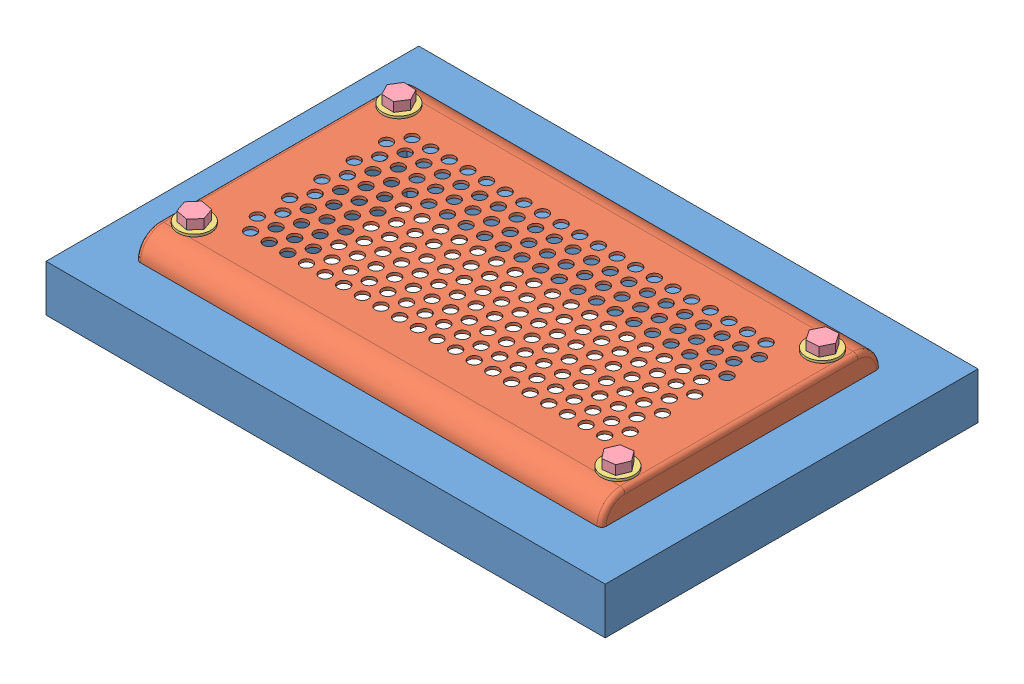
SolidWorks assembly temp cover assy.SLDASM, configuration Default (file format 5000). Lengths in mm.
Overall size (304.8 44.45 203.2).
10 component instances, 4 part files, 15 mates.
Components (placement in the parent):
- plate-1: plate.SLDPRT [Default] at (73.3686 0 48.3753) x (-1 0 0) z (0 0 -1) size (304.8 25.4 203.2)
- cover-1: cover.SLDPRT [Default] at (152.135 25.4 100.2719) x (-1 0 0) z (0 1 0) size (254 152.4 12.7)
- Washer Part-1: Washer Part.sldprt [Default] at (152.135 38.1 100.2719) x (-1 0 0) z (0 1 0) size (17.78 17.78 1.27)
- Bolt Part-5: Bolt Part.sldprt [Default] at origin size (13.22 44.45 12.7)
- Washer Part-5: Washer Part.sldprt [Default] at (383.019 38.1 -11.2416) x (-1 0 0) z (0 1 0) size (17.78 17.78 1.27)
- Washer Part-6: Washer Part.sldprt [Default] at (152.135 38.1 -11.2416) x (-1 0 0) z (0 1 0) size (17.78 17.78 1.27)
- Washer Part-7: Washer Part.sldprt [Default] at (383.019 38.1 100.2719) x (-1 0 0) z (0 1 0) size (17.78 17.78 1.27)
- Bolt Part-10: Bolt Part.sldprt [Default] at (-152.8504 0 23.1793) x (-0.618024 0 -0.786159) z (0.786159 0 -0.618024) size (13.22 44.45 12.7)
- Bolt Part-11: Bolt Part.sldprt [Default] at (276.5021 0 62.591) x (-0.262807 0 0.964848) z (-0.964848 0 -0.262807) size (13.22 44.45 12.7)
- Bolt Part-12: Bolt Part.sldprt [Default] at (93.5696 0 40.7386) x (0.200259 0 -0.979743) z (0.979743 0 0.200259) size (13.22 44.45 12.7)
Mates (geometry in assembly coordinates):
- Coincident1: coincident anti-aligned: plane of assembly through (0 0 0) normal (0 1 0); plane of plate-1 through (73.3686 0 48.3753) normal (0 -1 0)
- InPlace2: in place: plane of ? through (134.1311 38.1 -77.7838) normal (0 1 0); plane of ? through (0 38.1 0) normal (0 1 0); moOrthogonalPlaneRef_w of ? through (134.1311 38.1 -77.7838) normal (0 1 0); plane of ? through (0 38.1 0) normal (0 0 -1); plane of ? through (134.1311 38.1 -77.7838) normal (0 1 0); line of ? through (-55 0 38.1) axis (0 1 0); plane of cover-1 through (198.7387 38.1 -27.4772) normal (0 1 0); unknown of Washer Part-1
- Coincident17: coincident aligned: plane of cover-1; plane of Washer Part-1
- Coincident18: coincident aligned: moOrthogonalPlaneRef_w of cover-1 through (152.135 38.1 100.2719) normal (0 0 1); plane of Washer Part-1
- Coincident19: coincident anti-aligned: moOrthogonalPlaneRef_w of cover-1 through (152.135 38.1 100.2719) normal (1 0 0); plane of Washer Part-1
- Coincident2: coincident anti-aligned: plane of plate-1 through (73.3686 25.4 48.3753) normal (0 1 0); plane of cover-1 through (198.7387 25.4 -27.4772) normal (0 -1 0)
- Coincident3: coincident aligned: circle of cover-1; circle of Washer Part-6
- Coincident4: coincident aligned: circle of cover-1; circle of Washer Part-5
- Coincident5: coincident aligned: circle of cover-1; circle of Washer Part-7
- Concentric2: concentric anti-aligned: cylinder of Washer Part-6 through (-43.7032 39.37 -7.0339) axis (0 -1 0) radius 3.3; cylinder of Bolt Part-10 through (-43.7032 -9.3338 -7.0339) axis (0 1 0) radius 3.3
- Coincident6: coincident anti-aligned: plane of Washer Part-6 through (-43.7032 39.37 -7.0339) normal (0 1 0); plane of Bolt Part-10 through (-152.8504 39.37 23.1793) normal (0 -1 0)
- Concentric3: concentric anti-aligned: cylinder of Washer Part-5 through (187.1807 39.37 -7.0339) axis (0 -1 0) radius 3.3; cylinder of Bolt Part-11 through (187.1807 -9.3338 -7.0339) axis (0 1 0) radius 3.3
- Coincident7: coincident anti-aligned: plane of Washer Part-5 through (187.1807 39.37 -7.0339) normal (0 1 0); plane of Bolt Part-11 through (276.5021 39.37 62.591) normal (0 -1 0)
- Concentric4: concentric anti-aligned: cylinder of Washer Part-7 through (187.1807 39.37 104.4795) axis (0 -1 0) radius 8.89; cylinder of Bolt Part-12 through (187.1807 -9.3338 104.4795) axis (0 1 0) radius 3.3
- Coincident8: coincident anti-aligned: plane of Washer Part-7 through (187.1807 39.37 104.4795) normal (0 1 0); plane of Bolt Part-12 through (93.5696 39.37 40.7386) normal (0 -1 0)
